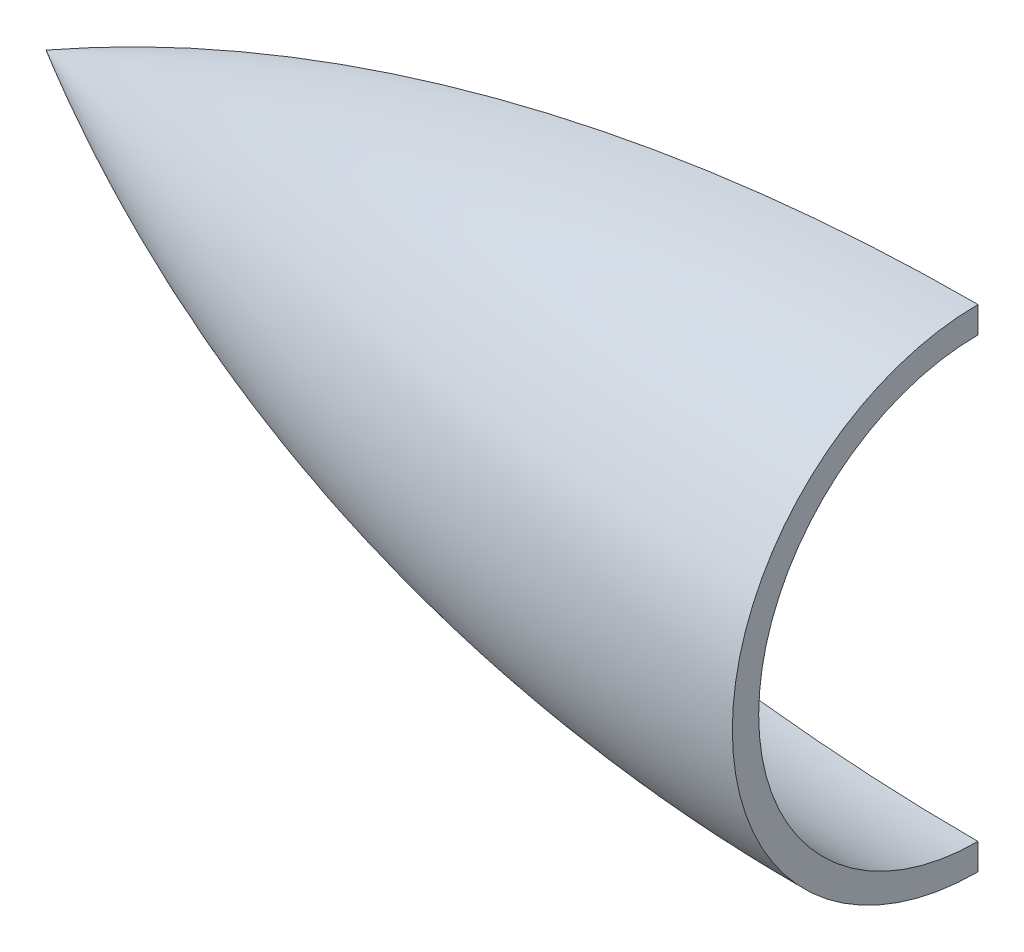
from build123d import *

# Parameters (mm, degrees)
REVOLVE4_ANGLE = 180


with BuildPart() as part:
    # Sketch1 → Revolve4 (revolve)
    with BuildSketch(Plane.XY):
        with BuildLine():
            Line((0, 107.95), (0, 109.474))
            ThreePointArc((0, 109.474), (-27.903030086, 105.858290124), (-53.96289629, 95.25))
            Line((-53.96289629, 95.25), (-50.8, 95.25))
            ThreePointArc((-50.8, 95.25), (-26.181720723, 104.726882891), (0, 107.95))
        make_face()
    revolve(axis=Axis((-53.96289629, 95.25, 0), (1, 0, 0)), revolution_arc=REVOLVE4_ANGLE)


solid = part.part
